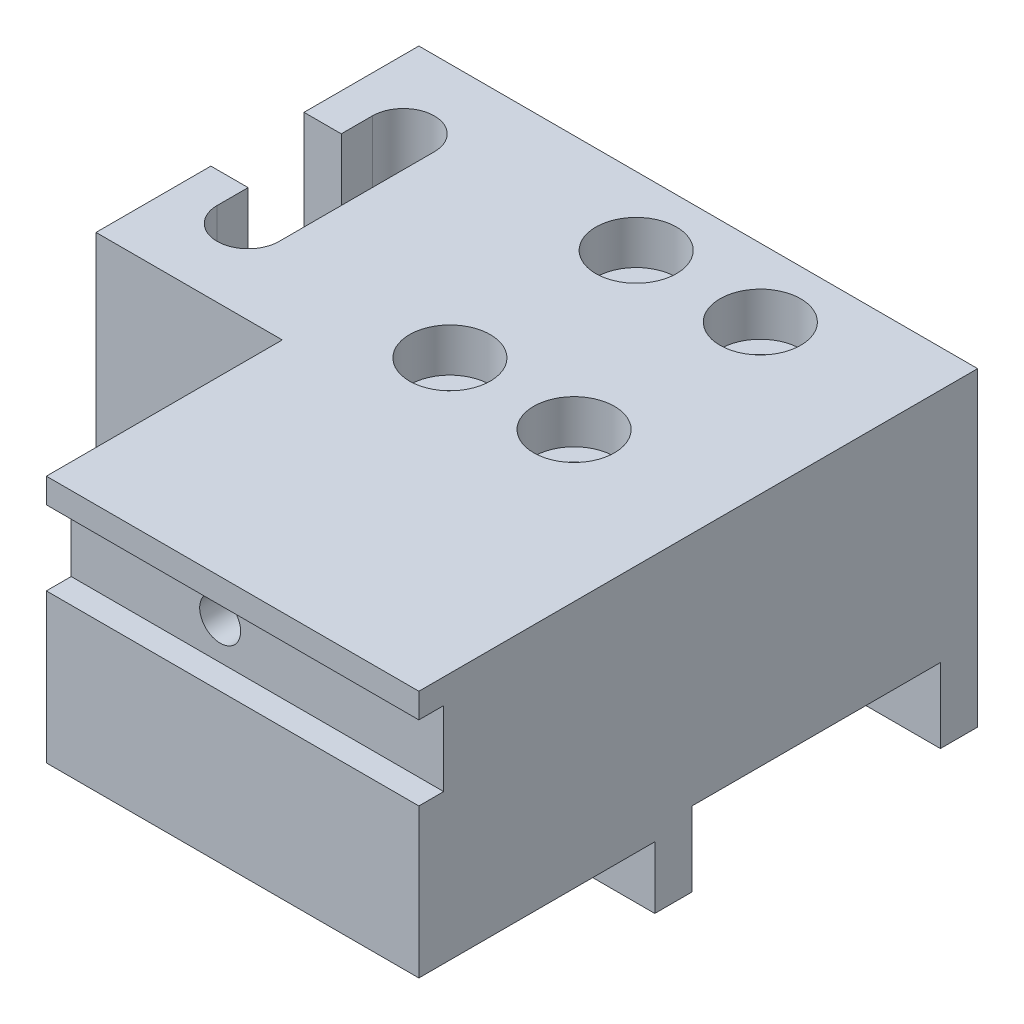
from build123d import *

# Parameters (mm, degrees)
EXTRUDE_1_DEPTH     = 45
SKETCH_2_OUTSIDE_W  = 60.674
SKETCH_2_OUTSIDE_H  = 40.674
CUT_EXTRUDE_1_DEPTH = 45
SKETCH_4_R          = 1.65
CUT_EXTRUDE_2_DEPTH = 15
SKETCH_5_R          = 1.65
CUT_EXTRUDE_3_DEPTH = 15
SKETCH_6_OUTSIDE_W  = 60.674
SKETCH_6_OUTSIDE_H  = 60.674
SKETCH_6_OUTSIDE_R  = 1.75
CUT_EXTRUDE_4_DEPTH = 69.373971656
SKETCH_7_R          = 3.25
CUT_EXTRUDE_5_DEPTH = 3.5
SKETCH_9_R          = 1.65
CUT_EXTRUDE_6_DEPTH = 4.5


with BuildPart() as part:
    # Sketch 1 → Extrude 1 (new body)
    with BuildSketch(Plane.XY):
        Polygon((15, 0), (15, 6), (0, 6), (0, 25), (45, 25), (45, 0), align=None)
    extrude(amount=EXTRUDE_1_DEPTH)

    # Sketch 2 outside → Cut-Extrude 1 (cut)
    with BuildSketch(Plane(origin=(45, 0, 0), x_dir=(0, 0, -1), z_dir=(1, 0, 0))):
        with Locations((-22.5, 12.5)):
            Rectangle(SKETCH_2_OUTSIDE_W, SKETCH_2_OUTSIDE_H)
        Polygon((-45, 25), (0, 25), (0, 0), (-3, 0), (-3, 6), (-23, 6), (-23, 0), (-26, 0), (-26, 5), (-45, 5), (-45, 17), (-43, 17), (-43, 23), (-45, 23), align=None, mode=Mode.SUBTRACT)
    extrude(amount=-CUT_EXTRUDE_1_DEPTH, mode=Mode.SUBTRACT)

    # Sketch 4 → Cut-Extrude 2 (cut)
    with BuildSketch(Plane.ZY):
        with Locations((31, 11)):
            Circle(SKETCH_4_R)
        with Locations((40, 11)):
            Circle(SKETCH_4_R)
    extrude(amount=-CUT_EXTRUDE_2_DEPTH, mode=Mode.SUBTRACT)

    # Sketch 5 → Cut-Extrude 3 (cut)
    with BuildSketch(Plane.XY.offset(43)):
        with Locations((27, 20)):
            Circle(SKETCH_5_R)
    extrude(amount=-CUT_EXTRUDE_3_DEPTH, mode=Mode.SUBTRACT)

    # Sketch 6 outside → Cut-Extrude 4 (cut, through all)
    # profile 1 of 5: a face of its own
    with BuildSketch(Plane(origin=(0, 25, 0), x_dir=(1, 0, 0), z_dir=(0, 1, 0))):
        with Locations((22.5, -22.5)):
            Rectangle(SKETCH_6_OUTSIDE_W, SKETCH_6_OUTSIDE_H)
        with BuildLine():
            Line((45, -45), (45, 0))
            Line((45, 0), (0, 0))
            Line((0, 0), (0, -9.25))
            Line((0, -9.25), (3, -9.25))
            Line((3, -9.25), (3, -6.75))
            ThreePointArc((3, -6.75), (5.5, -4.25), (8, -6.75))
            Line((8, -6.75), (8, -19.25))
            ThreePointArc((8, -19.25), (5.5, -21.75), (3, -19.25))
            Line((3, -19.25), (3, -16.75))
            Line((3, -16.75), (0, -16.75))
            Line((0, -16.75), (0, -26))
            Line((0, -26), (15, -26))
            Line((15, -26), (15, -45))
            Line((15, -45), (45, -45))
        make_face(mode=Mode.SUBTRACT)
    # profile 2 of 5: a face of its own
    with BuildSketch(Plane(origin=(0, 25, 0), x_dir=(1, 0, 0), z_dir=(0, 1, 0))):
        with Locations(Location((23, -5.5, 0), (0, 0, 270))):
            Circle(SKETCH_6_OUTSIDE_R)
    # profile 3 of 5: a face of its own
    with BuildSketch(Plane(origin=(0, 25, 0), x_dir=(1, 0, 0), z_dir=(0, 1, 0))):
        with Locations(Location((33, -5.5, 0), (0, 0, 270))):
            Circle(SKETCH_6_OUTSIDE_R)
    # profile 4 of 5: a face of its own
    with BuildSketch(Plane(origin=(0, 25, 0), x_dir=(1, 0, 0), z_dir=(0, 1, 0))):
        with Locations(Location((33, -20.5, 0), (0, 0, 270))):
            Circle(SKETCH_6_OUTSIDE_R)
    # profile 5 of 5: a face of its own
    with BuildSketch(Plane(origin=(0, 25, 0), x_dir=(1, 0, 0), z_dir=(0, 1, 0))):
        with Locations(Location((23, -20.5, 0), (0, 0, 270))):
            Circle(SKETCH_6_OUTSIDE_R)
    extrude(amount=-CUT_EXTRUDE_4_DEPTH, mode=Mode.SUBTRACT)

    # Sketch 7 → Cut-Extrude 5 (cut)
    with BuildSketch(Plane(origin=(0, 25, 0), x_dir=(1, 0, 0), z_dir=(0, 1, 0))):
        with Locations(Location((23, -5.5, 0), (0, 0, 270))):
            Circle(SKETCH_7_R)
        with Locations(Location((33, -5.5, 0), (0, 0, 270))):
            Circle(SKETCH_7_R)
        with Locations(Location((33, -20.5, 0), (0, 0, 270))):
            Circle(SKETCH_7_R)
        with Locations(Location((23, -20.5, 0), (0, 0, 270))):
            Circle(SKETCH_7_R)
    extrude(amount=-CUT_EXTRUDE_5_DEPTH, mode=Mode.SUBTRACT)

    # Sketch 9 → Cut-Extrude 6 (cut)
    with BuildSketch(Plane.ZY.offset(-15)):
        with Locations((31, 11)):
            Circle(SKETCH_9_R)
        with Locations((40, 11)):
            Circle(SKETCH_9_R)
    extrude(amount=-CUT_EXTRUDE_6_DEPTH, mode=Mode.SUBTRACT)


solid = part.part
